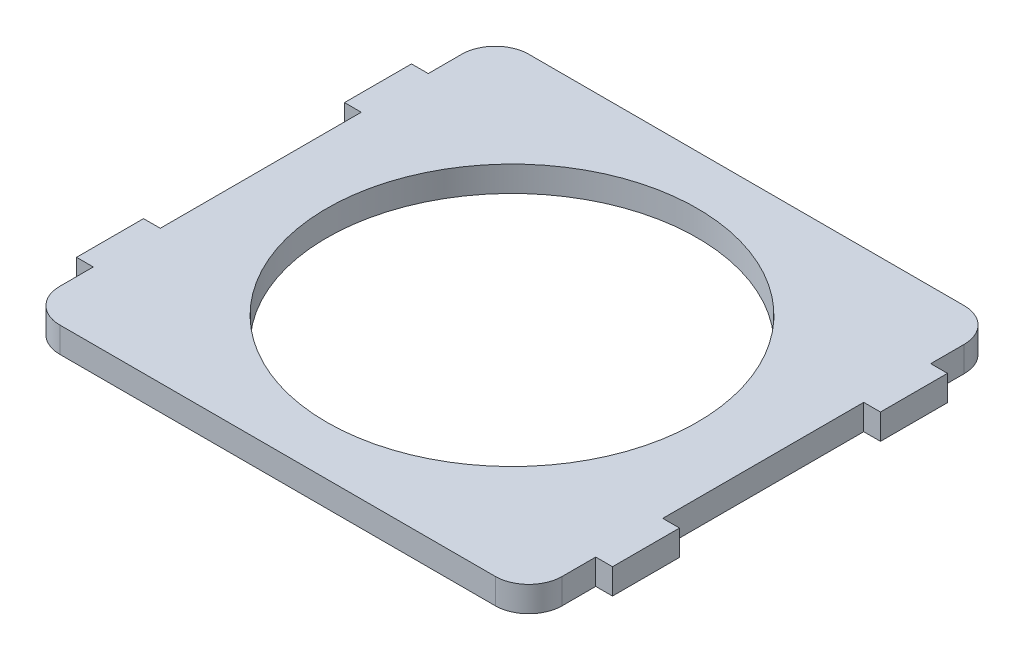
ISO-10303-21;
HEADER;
FILE_DESCRIPTION(('STEP AP214'),'2;1');
FILE_NAME('part.step','',(''),(''),'','','');
FILE_SCHEMA(('AUTOMOTIVE_DESIGN { 1 0 10303 214 1 1 1 1 }'));
ENDSEC;
DATA;
#1=APPLICATION_CONTEXT('core data for automotive mechanical design processes');
#2=APPLICATION_PROTOCOL_DEFINITION('international standard','automotive_design',2000,#1);
#3=PRODUCT_CONTEXT('',#1,'mechanical');
#4=PRODUCT('Part','Part','',(#3));
#5=PRODUCT_RELATED_PRODUCT_CATEGORY('part','',(#4));
#6=PRODUCT_DEFINITION_FORMATION('','',#4);
#7=PRODUCT_DEFINITION_CONTEXT('part definition',#1,'design');
#8=PRODUCT_DEFINITION('design','',#6,#7);
#9=PRODUCT_DEFINITION_SHAPE('','',#8);
#10=(LENGTH_UNIT() NAMED_UNIT(*) SI_UNIT(.MILLI.,.METRE.));
#11=(NAMED_UNIT(*) PLANE_ANGLE_UNIT() SI_UNIT($,.RADIAN.));
#12=(NAMED_UNIT(*) SI_UNIT($,.STERADIAN.) SOLID_ANGLE_UNIT());
#13=UNCERTAINTY_MEASURE_WITH_UNIT(LENGTH_MEASURE(1.E-05),#10,'distance_accuracy_value','');
#14=(GEOMETRIC_REPRESENTATION_CONTEXT(3) GLOBAL_UNCERTAINTY_ASSIGNED_CONTEXT((#13)) GLOBAL_UNIT_ASSIGNED_CONTEXT((#10,
#11,#12)) REPRESENTATION_CONTEXT('',''));
#15=CARTESIAN_POINT('',(0.,0.,0.));
#16=DIRECTION('',(0.,0.,1.));
#17=DIRECTION('',(1.,0.,0.));
#18=AXIS2_PLACEMENT_3D('',#15,#16,#17);
#19=CARTESIAN_POINT('',(0.,9.652,-177.8));
#20=DIRECTION('',(0.,1.,0.));
#21=DIRECTION('',(0.,0.,1.));
#22=AXIS2_PLACEMENT_3D('',#19,#20,#21);
#23=PLANE('',#22);
#24=DIRECTION('',(0.,0.,1.));
#25=VECTOR('',#24,1.);
#26=CARTESIAN_POINT('',(0.,9.652,-25.4));
#27=LINE('',#26,#25);
#28=CARTESIAN_POINT('',(0.,9.652,-25.4));
#29=VERTEX_POINT('',#28);
#30=CARTESIAN_POINT('',(0.,9.652,-12.7));
#31=VERTEX_POINT('',#30);
#32=EDGE_CURVE('E250',#29,#31,#27,.T.);
#33=ORIENTED_EDGE('',*,*,#32,.T.);
#34=CARTESIAN_POINT('',(12.7,9.652,-12.7));
#35=DIRECTION('',(0.,1.,0.));
#36=DIRECTION('',(0.,0.,1.));
#37=AXIS2_PLACEMENT_3D('',#34,#35,#36);
#38=CIRCLE('',#37,12.7);
#39=CARTESIAN_POINT('',(12.7,9.652,0.));
#40=VERTEX_POINT('',#39);
#41=EDGE_CURVE('E354',#31,#40,#38,.T.);
#42=ORIENTED_EDGE('',*,*,#41,.T.);
#43=DIRECTION('',(1.,0.,0.));
#44=VECTOR('',#43,1.);
#45=CARTESIAN_POINT('',(0.,9.652,0.));
#46=LINE('',#45,#44);
#47=CARTESIAN_POINT('',(177.8,9.652,0.));
#48=VERTEX_POINT('',#47);
#49=EDGE_CURVE('E253',#40,#48,#46,.T.);
#50=ORIENTED_EDGE('',*,*,#49,.T.);
#51=CARTESIAN_POINT('',(177.8,9.652,-12.7));
#52=DIRECTION('',(0.,1.,0.));
#53=DIRECTION('',(0.,0.,1.));
#54=AXIS2_PLACEMENT_3D('',#51,#52,#53);
#55=CIRCLE('',#54,12.7);
#56=CARTESIAN_POINT('',(190.5,9.652,-12.7));
#57=VERTEX_POINT('',#56);
#58=EDGE_CURVE('E349',#48,#57,#55,.T.);
#59=ORIENTED_EDGE('',*,*,#58,.T.);
#60=DIRECTION('',(0.,0.,-1.));
#61=VECTOR('',#60,1.);
#62=CARTESIAN_POINT('',(190.5,9.652,-25.4000000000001));
#63=LINE('',#62,#61);
#64=CARTESIAN_POINT('',(190.5,9.652,-25.4000000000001));
#65=VERTEX_POINT('',#64);
#66=EDGE_CURVE('E256',#57,#65,#63,.T.);
#67=ORIENTED_EDGE('',*,*,#66,.T.);
#68=DIRECTION('',(1.,0.,0.));
#69=VECTOR('',#68,1.);
#70=CARTESIAN_POINT('',(196.85,9.652,-25.4));
#71=LINE('',#70,#69);
#72=CARTESIAN_POINT('',(196.85,9.652,-25.4));
#73=VERTEX_POINT('',#72);
#74=EDGE_CURVE('E205',#65,#73,#71,.T.);
#75=ORIENTED_EDGE('',*,*,#74,.T.);
#76=DIRECTION('',(0.,0.,-1.));
#77=VECTOR('',#76,1.);
#78=CARTESIAN_POINT('',(196.85,9.652,-50.8000000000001));
#79=LINE('',#78,#77);
#80=CARTESIAN_POINT('',(196.85,9.652,-50.8000000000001));
#81=VERTEX_POINT('',#80);
#82=EDGE_CURVE('E259',#73,#81,#79,.T.);
#83=ORIENTED_EDGE('',*,*,#82,.T.);
#84=DIRECTION('',(-1.,0.,0.));
#85=VECTOR('',#84,1.);
#86=CARTESIAN_POINT('',(190.5,9.652,-50.8000000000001));
#87=LINE('',#86,#85);
#88=CARTESIAN_POINT('',(190.5,9.652,-50.8000000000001));
#89=VERTEX_POINT('',#88);
#90=EDGE_CURVE('E261',#81,#89,#87,.T.);
#91=ORIENTED_EDGE('',*,*,#90,.T.);
#92=DIRECTION('',(0.,0.,-1.));
#93=VECTOR('',#92,1.);
#94=CARTESIAN_POINT('',(190.5,9.652,-127.));
#95=LINE('',#94,#93);
#96=CARTESIAN_POINT('',(190.5,9.652,-127.));
#97=VERTEX_POINT('',#96);
#98=EDGE_CURVE('E263',#89,#97,#95,.T.);
#99=ORIENTED_EDGE('',*,*,#98,.T.);
#100=DIRECTION('',(1.,0.,0.));
#101=VECTOR('',#100,1.);
#102=CARTESIAN_POINT('',(196.85,9.652,-127.));
#103=LINE('',#102,#101);
#104=CARTESIAN_POINT('',(196.85,9.652,-127.));
#105=VERTEX_POINT('',#104);
#106=EDGE_CURVE('E265',#97,#105,#103,.T.);
#107=ORIENTED_EDGE('',*,*,#106,.T.);
#108=DIRECTION('',(0.,0.,-1.));
#109=VECTOR('',#108,1.);
#110=CARTESIAN_POINT('',(196.85,9.652,-152.4));
#111=LINE('',#110,#109);
#112=CARTESIAN_POINT('',(196.85,9.652,-152.4));
#113=VERTEX_POINT('',#112);
#114=EDGE_CURVE('E267',#105,#113,#111,.T.);
#115=ORIENTED_EDGE('',*,*,#114,.T.);
#116=DIRECTION('',(-1.,0.,0.));
#117=VECTOR('',#116,1.);
#118=CARTESIAN_POINT('',(190.5,9.652,-152.4));
#119=LINE('',#118,#117);
#120=CARTESIAN_POINT('',(190.5,9.652,-152.4));
#121=VERTEX_POINT('',#120);
#122=EDGE_CURVE('E269',#113,#121,#119,.T.);
#123=ORIENTED_EDGE('',*,*,#122,.T.);
#124=DIRECTION('',(0.,0.,-1.));
#125=VECTOR('',#124,1.);
#126=CARTESIAN_POINT('',(190.5,9.652,-177.8));
#127=LINE('',#126,#125);
#128=CARTESIAN_POINT('',(190.5,9.652,-165.1));
#129=VERTEX_POINT('',#128);
#130=EDGE_CURVE('E271',#121,#129,#127,.T.);
#131=ORIENTED_EDGE('',*,*,#130,.T.);
#132=CARTESIAN_POINT('',(177.8,9.652,-165.1));
#133=DIRECTION('',(0.,1.,0.));
#134=DIRECTION('',(0.,0.,1.));
#135=AXIS2_PLACEMENT_3D('',#132,#133,#134);
#136=CIRCLE('',#135,12.7);
#137=CARTESIAN_POINT('',(177.8,9.652,-177.8));
#138=VERTEX_POINT('',#137);
#139=EDGE_CURVE('E351',#129,#138,#136,.T.);
#140=ORIENTED_EDGE('',*,*,#139,.T.);
#141=DIRECTION('',(-1.,0.,0.));
#142=VECTOR('',#141,1.);
#143=CARTESIAN_POINT('',(0.,9.652,-177.8));
#144=LINE('',#143,#142);
#145=CARTESIAN_POINT('',(12.7,9.652,-177.8));
#146=VERTEX_POINT('',#145);
#147=EDGE_CURVE('E274',#138,#146,#144,.T.);
#148=ORIENTED_EDGE('',*,*,#147,.T.);
#149=CARTESIAN_POINT('',(12.7,9.652,-165.1));
#150=DIRECTION('',(0.,1.,0.));
#151=DIRECTION('',(0.,0.,1.));
#152=AXIS2_PLACEMENT_3D('',#149,#150,#151);
#153=CIRCLE('',#152,12.7);
#154=CARTESIAN_POINT('',(0.,9.652,-165.1));
#155=VERTEX_POINT('',#154);
#156=EDGE_CURVE('E41',#146,#155,#153,.T.);
#157=ORIENTED_EDGE('',*,*,#156,.T.);
#158=DIRECTION('',(0.,0.,1.));
#159=VECTOR('',#158,1.);
#160=CARTESIAN_POINT('',(0.,9.652,-177.8));
#161=LINE('',#160,#159);
#162=CARTESIAN_POINT('',(0.,9.652,-152.4));
#163=VERTEX_POINT('',#162);
#164=EDGE_CURVE('E276',#155,#163,#161,.T.);
#165=ORIENTED_EDGE('',*,*,#164,.T.);
#166=DIRECTION('',(-1.,0.,0.));
#167=VECTOR('',#166,1.);
#168=CARTESIAN_POINT('',(0.,9.652,-152.4));
#169=LINE('',#168,#167);
#170=CARTESIAN_POINT('',(-6.34999999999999,9.652,-152.4));
#171=VERTEX_POINT('',#170);
#172=EDGE_CURVE('E278',#163,#171,#169,.T.);
#173=ORIENTED_EDGE('',*,*,#172,.T.);
#174=DIRECTION('',(0.,0.,1.));
#175=VECTOR('',#174,1.);
#176=CARTESIAN_POINT('',(-6.34999999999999,9.652,-152.4));
#177=LINE('',#176,#175);
#178=CARTESIAN_POINT('',(-6.34999999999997,9.652,-127.));
#179=VERTEX_POINT('',#178);
#180=EDGE_CURVE('E280',#171,#179,#177,.T.);
#181=ORIENTED_EDGE('',*,*,#180,.T.);
#182=DIRECTION('',(1.,0.,0.));
#183=VECTOR('',#182,1.);
#184=CARTESIAN_POINT('',(-6.34999999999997,9.652,-127.));
#185=LINE('',#184,#183);
#186=CARTESIAN_POINT('',(0.,9.652,-127.));
#187=VERTEX_POINT('',#186);
#188=EDGE_CURVE('E282',#179,#187,#185,.T.);
#189=ORIENTED_EDGE('',*,*,#188,.T.);
#190=DIRECTION('',(0.,0.,1.));
#191=VECTOR('',#190,1.);
#192=CARTESIAN_POINT('',(0.,9.652,-127.));
#193=LINE('',#192,#191);
#194=CARTESIAN_POINT('',(0.,9.652,-50.8000000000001));
#195=VERTEX_POINT('',#194);
#196=EDGE_CURVE('E284',#187,#195,#193,.T.);
#197=ORIENTED_EDGE('',*,*,#196,.T.);
#198=DIRECTION('',(-1.,0.,0.));
#199=VECTOR('',#198,1.);
#200=CARTESIAN_POINT('',(0.,9.652,-50.8000000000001));
#201=LINE('',#200,#199);
#202=CARTESIAN_POINT('',(-6.34999999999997,9.652,-50.8000000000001));
#203=VERTEX_POINT('',#202);
#204=EDGE_CURVE('E286',#195,#203,#201,.T.);
#205=ORIENTED_EDGE('',*,*,#204,.T.);
#206=DIRECTION('',(0.,0.,1.));
#207=VECTOR('',#206,1.);
#208=CARTESIAN_POINT('',(-6.34999999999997,9.652,-50.8000000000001));
#209=LINE('',#208,#207);
#210=CARTESIAN_POINT('',(-6.34999999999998,9.652,-25.4));
#211=VERTEX_POINT('',#210);
#212=EDGE_CURVE('E288',#203,#211,#209,.T.);
#213=ORIENTED_EDGE('',*,*,#212,.T.);
#214=DIRECTION('',(1.,0.,0.));
#215=VECTOR('',#214,1.);
#216=CARTESIAN_POINT('',(-6.34999999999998,9.652,-25.4));
#217=LINE('',#216,#215);
#218=EDGE_CURVE('E290',#211,#29,#217,.T.);
#219=ORIENTED_EDGE('',*,*,#218,.T.);
#220=EDGE_LOOP('',(#33,#42,#50,#59,#67,#75,#83,#91,#99,#107,#115,#123,#131,#140,#148,#157,#165,
#173,#181,#189,#197,#205,#213,#219));
#221=FACE_BOUND('',#220,.T.);
#222=CARTESIAN_POINT('',(95.25,9.652,-88.9));
#223=DIRECTION('',(0.,1.,0.));
#224=DIRECTION('',(0.,0.,1.));
#225=AXIS2_PLACEMENT_3D('',#222,#223,#224);
#226=CIRCLE('',#225,70.231);
#227=CARTESIAN_POINT('',(95.25,9.652,-18.669));
#228=VERTEX_POINT('',#227);
#229=EDGE_CURVE('E539',#228,#228,#226,.T.);
#230=ORIENTED_EDGE('',*,*,#229,.F.);
#231=EDGE_LOOP('',(#230));
#232=FACE_BOUND('',#231,.T.);
#233=ADVANCED_FACE('F26',(#221,#232),#23,.T.);
#234=CARTESIAN_POINT('',(0.,0.,-177.8));
#235=DIRECTION('',(0.,1.,0.));
#236=DIRECTION('',(0.,0.,1.));
#237=AXIS2_PLACEMENT_3D('',#234,#235,#236);
#238=PLANE('',#237);
#239=DIRECTION('',(1.,0.,0.));
#240=VECTOR('',#239,1.);
#241=CARTESIAN_POINT('',(0.,0.,0.));
#242=LINE('',#241,#240);
#243=CARTESIAN_POINT('',(12.7,0.,0.));
#244=VERTEX_POINT('',#243);
#245=CARTESIAN_POINT('',(177.8,0.,0.));
#246=VERTEX_POINT('',#245);
#247=EDGE_CURVE('E199',#244,#246,#242,.T.);
#248=ORIENTED_EDGE('',*,*,#247,.F.);
#249=CARTESIAN_POINT('',(12.7,0.,-12.7));
#250=DIRECTION('',(0.,1.,0.));
#251=DIRECTION('',(0.,0.,1.));
#252=AXIS2_PLACEMENT_3D('',#249,#250,#251);
#253=CIRCLE('',#252,12.7);
#254=CARTESIAN_POINT('',(0.,0.,-12.7));
#255=VERTEX_POINT('',#254);
#256=EDGE_CURVE('E345',#244,#255,#253,.F.);
#257=ORIENTED_EDGE('',*,*,#256,.T.);
#258=DIRECTION('',(0.,0.,1.));
#259=VECTOR('',#258,1.);
#260=CARTESIAN_POINT('',(0.,0.,-25.4));
#261=LINE('',#260,#259);
#262=CARTESIAN_POINT('',(0.,0.,-25.4));
#263=VERTEX_POINT('',#262);
#264=EDGE_CURVE('E424',#263,#255,#261,.T.);
#265=ORIENTED_EDGE('',*,*,#264,.F.);
#266=DIRECTION('',(1.,0.,0.));
#267=VECTOR('',#266,1.);
#268=CARTESIAN_POINT('',(-6.34999999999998,0.,-25.4));
#269=LINE('',#268,#267);
#270=CARTESIAN_POINT('',(-6.34999999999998,0.,-25.4));
#271=VERTEX_POINT('',#270);
#272=EDGE_CURVE('E248',#271,#263,#269,.T.);
#273=ORIENTED_EDGE('',*,*,#272,.F.);
#274=DIRECTION('',(0.,0.,1.));
#275=VECTOR('',#274,1.);
#276=CARTESIAN_POINT('',(-6.34999999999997,0.,-50.8000000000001));
#277=LINE('',#276,#275);
#278=CARTESIAN_POINT('',(-6.34999999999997,0.,-50.8000000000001));
#279=VERTEX_POINT('',#278);
#280=EDGE_CURVE('E246',#279,#271,#277,.T.);
#281=ORIENTED_EDGE('',*,*,#280,.F.);
#282=DIRECTION('',(-1.,0.,0.));
#283=VECTOR('',#282,1.);
#284=CARTESIAN_POINT('',(0.,0.,-50.8000000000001));
#285=LINE('',#284,#283);
#286=CARTESIAN_POINT('',(0.,0.,-50.8000000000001));
#287=VERTEX_POINT('',#286);
#288=EDGE_CURVE('E244',#287,#279,#285,.T.);
#289=ORIENTED_EDGE('',*,*,#288,.F.);
#290=DIRECTION('',(0.,0.,1.));
#291=VECTOR('',#290,1.);
#292=CARTESIAN_POINT('',(0.,0.,-127.));
#293=LINE('',#292,#291);
#294=CARTESIAN_POINT('',(0.,0.,-127.));
#295=VERTEX_POINT('',#294);
#296=EDGE_CURVE('E242',#295,#287,#293,.T.);
#297=ORIENTED_EDGE('',*,*,#296,.F.);
#298=DIRECTION('',(1.,0.,0.));
#299=VECTOR('',#298,1.);
#300=CARTESIAN_POINT('',(-6.34999999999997,0.,-127.));
#301=LINE('',#300,#299);
#302=CARTESIAN_POINT('',(-6.34999999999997,0.,-127.));
#303=VERTEX_POINT('',#302);
#304=EDGE_CURVE('E240',#303,#295,#301,.T.);
#305=ORIENTED_EDGE('',*,*,#304,.F.);
#306=DIRECTION('',(0.,0.,1.));
#307=VECTOR('',#306,1.);
#308=CARTESIAN_POINT('',(-6.34999999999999,0.,-152.4));
#309=LINE('',#308,#307);
#310=CARTESIAN_POINT('',(-6.34999999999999,0.,-152.4));
#311=VERTEX_POINT('',#310);
#312=EDGE_CURVE('E238',#311,#303,#309,.T.);
#313=ORIENTED_EDGE('',*,*,#312,.F.);
#314=DIRECTION('',(-1.,0.,0.));
#315=VECTOR('',#314,1.);
#316=CARTESIAN_POINT('',(0.,0.,-152.4));
#317=LINE('',#316,#315);
#318=CARTESIAN_POINT('',(0.,0.,-152.4));
#319=VERTEX_POINT('',#318);
#320=EDGE_CURVE('E236',#319,#311,#317,.T.);
#321=ORIENTED_EDGE('',*,*,#320,.F.);
#322=DIRECTION('',(0.,0.,1.));
#323=VECTOR('',#322,1.);
#324=CARTESIAN_POINT('',(0.,0.,-177.8));
#325=LINE('',#324,#323);
#326=CARTESIAN_POINT('',(0.,0.,-165.1));
#327=VERTEX_POINT('',#326);
#328=EDGE_CURVE('E234',#327,#319,#325,.T.);
#329=ORIENTED_EDGE('',*,*,#328,.F.);
#330=CARTESIAN_POINT('',(12.7,0.,-165.1));
#331=DIRECTION('',(0.,1.,0.));
#332=DIRECTION('',(0.,0.,1.));
#333=AXIS2_PLACEMENT_3D('',#330,#331,#332);
#334=CIRCLE('',#333,12.7);
#335=CARTESIAN_POINT('',(12.7,0.,-177.8));
#336=VERTEX_POINT('',#335);
#337=EDGE_CURVE('E343',#327,#336,#334,.F.);
#338=ORIENTED_EDGE('',*,*,#337,.T.);
#339=DIRECTION('',(-1.,0.,0.));
#340=VECTOR('',#339,1.);
#341=CARTESIAN_POINT('',(0.,0.,-177.8));
#342=LINE('',#341,#340);
#343=CARTESIAN_POINT('',(177.8,0.,-177.8));
#344=VERTEX_POINT('',#343);
#345=EDGE_CURVE('E232',#344,#336,#342,.T.);
#346=ORIENTED_EDGE('',*,*,#345,.F.);
#347=CARTESIAN_POINT('',(177.8,0.,-165.1));
#348=DIRECTION('',(0.,1.,0.));
#349=DIRECTION('',(0.,0.,1.));
#350=AXIS2_PLACEMENT_3D('',#347,#348,#349);
#351=CIRCLE('',#350,12.7);
#352=CARTESIAN_POINT('',(190.5,0.,-165.1));
#353=VERTEX_POINT('',#352);
#354=EDGE_CURVE('E341',#344,#353,#351,.F.);
#355=ORIENTED_EDGE('',*,*,#354,.T.);
#356=DIRECTION('',(0.,0.,-1.));
#357=VECTOR('',#356,1.);
#358=CARTESIAN_POINT('',(190.5,0.,-177.8));
#359=LINE('',#358,#357);
#360=CARTESIAN_POINT('',(190.5,0.,-152.4));
#361=VERTEX_POINT('',#360);
#362=EDGE_CURVE('E229',#361,#353,#359,.T.);
#363=ORIENTED_EDGE('',*,*,#362,.F.);
#364=DIRECTION('',(-1.,0.,0.));
#365=VECTOR('',#364,1.);
#366=CARTESIAN_POINT('',(190.5,0.,-152.4));
#367=LINE('',#366,#365);
#368=CARTESIAN_POINT('',(196.85,0.,-152.4));
#369=VERTEX_POINT('',#368);
#370=EDGE_CURVE('E227',#369,#361,#367,.T.);
#371=ORIENTED_EDGE('',*,*,#370,.F.);
#372=DIRECTION('',(0.,0.,-1.));
#373=VECTOR('',#372,1.);
#374=CARTESIAN_POINT('',(196.85,0.,-152.4));
#375=LINE('',#374,#373);
#376=CARTESIAN_POINT('',(196.85,0.,-127.));
#377=VERTEX_POINT('',#376);
#378=EDGE_CURVE('E225',#377,#369,#375,.T.);
#379=ORIENTED_EDGE('',*,*,#378,.F.);
#380=DIRECTION('',(1.,0.,0.));
#381=VECTOR('',#380,1.);
#382=CARTESIAN_POINT('',(196.85,0.,-127.));
#383=LINE('',#382,#381);
#384=CARTESIAN_POINT('',(190.5,0.,-127.));
#385=VERTEX_POINT('',#384);
#386=EDGE_CURVE('E223',#385,#377,#383,.T.);
#387=ORIENTED_EDGE('',*,*,#386,.F.);
#388=DIRECTION('',(0.,0.,-1.));
#389=VECTOR('',#388,1.);
#390=CARTESIAN_POINT('',(190.5,0.,-127.));
#391=LINE('',#390,#389);
#392=CARTESIAN_POINT('',(190.5,0.,-50.8000000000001));
#393=VERTEX_POINT('',#392);
#394=EDGE_CURVE('E221',#393,#385,#391,.T.);
#395=ORIENTED_EDGE('',*,*,#394,.F.);
#396=DIRECTION('',(-1.,0.,0.));
#397=VECTOR('',#396,1.);
#398=CARTESIAN_POINT('',(190.5,0.,-50.8000000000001));
#399=LINE('',#398,#397);
#400=CARTESIAN_POINT('',(196.85,0.,-50.8000000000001));
#401=VERTEX_POINT('',#400);
#402=EDGE_CURVE('E216',#401,#393,#399,.T.);
#403=ORIENTED_EDGE('',*,*,#402,.F.);
#404=DIRECTION('',(0.,0.,-1.));
#405=VECTOR('',#404,1.);
#406=CARTESIAN_POINT('',(196.85,0.,-50.8000000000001));
#407=LINE('',#406,#405);
#408=CARTESIAN_POINT('',(196.85,0.,-25.4));
#409=VERTEX_POINT('',#408);
#410=EDGE_CURVE('E214',#409,#401,#407,.T.);
#411=ORIENTED_EDGE('',*,*,#410,.F.);
#412=DIRECTION('',(1.,0.,0.));
#413=VECTOR('',#412,1.);
#414=CARTESIAN_POINT('',(196.85,0.,-25.4));
#415=LINE('',#414,#413);
#416=CARTESIAN_POINT('',(190.5,0.,-25.4000000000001));
#417=VERTEX_POINT('',#416);
#418=EDGE_CURVE('E198',#417,#409,#415,.T.);
#419=ORIENTED_EDGE('',*,*,#418,.F.);
#420=DIRECTION('',(0.,0.,-1.));
#421=VECTOR('',#420,1.);
#422=CARTESIAN_POINT('',(190.5,0.,-25.4000000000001));
#423=LINE('',#422,#421);
#424=CARTESIAN_POINT('',(190.5,0.,-12.7));
#425=VERTEX_POINT('',#424);
#426=EDGE_CURVE('E189',#425,#417,#423,.T.);
#427=ORIENTED_EDGE('',*,*,#426,.F.);
#428=CARTESIAN_POINT('',(177.8,0.,-12.7));
#429=DIRECTION('',(0.,1.,0.));
#430=DIRECTION('',(0.,0.,1.));
#431=AXIS2_PLACEMENT_3D('',#428,#429,#430);
#432=CIRCLE('',#431,12.7);
#433=EDGE_CURVE('E339',#425,#246,#432,.F.);
#434=ORIENTED_EDGE('',*,*,#433,.T.);
#435=EDGE_LOOP('',(#248,#257,#265,#273,#281,#289,#297,#305,#313,#321,#329,#338,#346,#355,#363,
#371,#379,#387,#395,#403,#411,#419,#427,#434));
#436=FACE_BOUND('',#435,.T.);
#437=CARTESIAN_POINT('',(95.25,0.,-88.9));
#438=DIRECTION('',(0.,1.,0.));
#439=DIRECTION('',(0.,0.,1.));
#440=AXIS2_PLACEMENT_3D('',#437,#438,#439);
#441=CIRCLE('',#440,70.231);
#442=CARTESIAN_POINT('',(95.25,0.,-18.669));
#443=VERTEX_POINT('',#442);
#444=EDGE_CURVE('E542',#443,#443,#441,.T.);
#445=ORIENTED_EDGE('',*,*,#444,.T.);
#446=EDGE_LOOP('',(#445));
#447=FACE_BOUND('',#446,.T.);
#448=ADVANCED_FACE('F211',(#436,#447),#238,.F.);
#449=CARTESIAN_POINT('',(0.,9.652,-25.4));
#450=DIRECTION('',(1.,0.,0.));
#451=DIRECTION('',(0.,0.,-1.));
#452=AXIS2_PLACEMENT_3D('',#449,#450,#451);
#453=PLANE('',#452);
#454=ORIENTED_EDGE('',*,*,#264,.T.);
#455=DIRECTION('',(0.,-1.,0.));
#456=VECTOR('',#455,1.);
#457=CARTESIAN_POINT('',(0.,9.652,-12.7));
#458=LINE('',#457,#456);
#459=EDGE_CURVE('E347',#255,#31,#458,.F.);
#460=ORIENTED_EDGE('',*,*,#459,.T.);
#461=ORIENTED_EDGE('',*,*,#32,.F.);
#462=DIRECTION('',(0.,-1.,0.));
#463=VECTOR('',#462,1.);
#464=CARTESIAN_POINT('',(0.,9.652,-25.4));
#465=LINE('',#464,#463);
#466=EDGE_CURVE('E292',#29,#263,#465,.T.);
#467=ORIENTED_EDGE('',*,*,#466,.T.);
#468=EDGE_LOOP('',(#454,#460,#461,#467));
#469=FACE_BOUND('',#468,.T.);
#470=ADVANCED_FACE('F28',(#469),#453,.F.);
#471=CARTESIAN_POINT('',(0.,9.652,0.));
#472=DIRECTION('',(0.,0.,-1.));
#473=DIRECTION('',(-1.,0.,0.));
#474=AXIS2_PLACEMENT_3D('',#471,#472,#473);
#475=PLANE('',#474);
#476=ORIENTED_EDGE('',*,*,#49,.F.);
#477=DIRECTION('',(0.,-1.,0.));
#478=VECTOR('',#477,1.);
#479=CARTESIAN_POINT('',(12.7,9.652,0.));
#480=LINE('',#479,#478);
#481=EDGE_CURVE('E336',#40,#244,#480,.T.);
#482=ORIENTED_EDGE('',*,*,#481,.T.);
#483=ORIENTED_EDGE('',*,*,#247,.T.);
#484=DIRECTION('',(0.,-1.,0.));
#485=VECTOR('',#484,1.);
#486=CARTESIAN_POINT('',(177.8,9.652,0.));
#487=LINE('',#486,#485);
#488=EDGE_CURVE('E206',#246,#48,#487,.F.);
#489=ORIENTED_EDGE('',*,*,#488,.T.);
#490=EDGE_LOOP('',(#476,#482,#483,#489));
#491=FACE_BOUND('',#490,.T.);
#492=ADVANCED_FACE('F431',(#491),#475,.F.);
#493=CARTESIAN_POINT('',(190.5,9.652,-25.4000000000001));
#494=DIRECTION('',(-1.,0.,0.));
#495=DIRECTION('',(0.,0.,1.));
#496=AXIS2_PLACEMENT_3D('',#493,#494,#495);
#497=PLANE('',#496);
#498=ORIENTED_EDGE('',*,*,#66,.F.);
#499=DIRECTION('',(0.,-1.,0.));
#500=VECTOR('',#499,1.);
#501=CARTESIAN_POINT('',(190.5,9.652,-12.7));
#502=LINE('',#501,#500);
#503=EDGE_CURVE('E11',#57,#425,#502,.T.);
#504=ORIENTED_EDGE('',*,*,#503,.T.);
#505=ORIENTED_EDGE('',*,*,#426,.T.);
#506=DIRECTION('',(0.,-1.,0.));
#507=VECTOR('',#506,1.);
#508=CARTESIAN_POINT('',(190.5,9.652,-25.4000000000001));
#509=LINE('',#508,#507);
#510=EDGE_CURVE('E193',#65,#417,#509,.T.);
#511=ORIENTED_EDGE('',*,*,#510,.F.);
#512=EDGE_LOOP('',(#498,#504,#505,#511));
#513=FACE_BOUND('',#512,.T.);
#514=ADVANCED_FACE('F192',(#513),#497,.F.);
#515=CARTESIAN_POINT('',(196.85,9.652,-25.4));
#516=DIRECTION('',(0.,0.,-1.));
#517=DIRECTION('',(-1.,0.,0.));
#518=AXIS2_PLACEMENT_3D('',#515,#516,#517);
#519=PLANE('',#518);
#520=ORIENTED_EDGE('',*,*,#418,.T.);
#521=DIRECTION('',(0.,-1.,0.));
#522=VECTOR('',#521,1.);
#523=CARTESIAN_POINT('',(196.85,9.652,-25.4));
#524=LINE('',#523,#522);
#525=EDGE_CURVE('E207',#73,#409,#524,.T.);
#526=ORIENTED_EDGE('',*,*,#525,.F.);
#527=ORIENTED_EDGE('',*,*,#74,.F.);
#528=ORIENTED_EDGE('',*,*,#510,.T.);
#529=EDGE_LOOP('',(#520,#526,#527,#528));
#530=FACE_BOUND('',#529,.T.);
#531=ADVANCED_FACE('F202',(#530),#519,.F.);
#532=CARTESIAN_POINT('',(196.85,9.652,-50.8000000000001));
#533=DIRECTION('',(-1.,0.,0.));
#534=DIRECTION('',(0.,0.,1.));
#535=AXIS2_PLACEMENT_3D('',#532,#533,#534);
#536=PLANE('',#535);
#537=ORIENTED_EDGE('',*,*,#410,.T.);
#538=DIRECTION('',(0.,-1.,0.));
#539=VECTOR('',#538,1.);
#540=CARTESIAN_POINT('',(196.85,9.652,-50.8000000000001));
#541=LINE('',#540,#539);
#542=EDGE_CURVE('E331',#81,#401,#541,.T.);
#543=ORIENTED_EDGE('',*,*,#542,.F.);
#544=ORIENTED_EDGE('',*,*,#82,.F.);
#545=ORIENTED_EDGE('',*,*,#525,.T.);
#546=EDGE_LOOP('',(#537,#543,#544,#545));
#547=FACE_BOUND('',#546,.T.);
#548=ADVANCED_FACE('F439',(#547),#536,.F.);
#549=CARTESIAN_POINT('',(190.5,9.652,-50.8000000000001));
#550=DIRECTION('',(0.,0.,1.));
#551=DIRECTION('',(1.,0.,0.));
#552=AXIS2_PLACEMENT_3D('',#549,#550,#551);
#553=PLANE('',#552);
#554=ORIENTED_EDGE('',*,*,#402,.T.);
#555=DIRECTION('',(0.,-1.,0.));
#556=VECTOR('',#555,1.);
#557=CARTESIAN_POINT('',(190.5,9.652,-50.8000000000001));
#558=LINE('',#557,#556);
#559=EDGE_CURVE('E328',#89,#393,#558,.T.);
#560=ORIENTED_EDGE('',*,*,#559,.F.);
#561=ORIENTED_EDGE('',*,*,#90,.F.);
#562=ORIENTED_EDGE('',*,*,#542,.T.);
#563=EDGE_LOOP('',(#554,#560,#561,#562));
#564=FACE_BOUND('',#563,.T.);
#565=ADVANCED_FACE('F443',(#564),#553,.F.);
#566=CARTESIAN_POINT('',(190.5,9.652,-127.));
#567=DIRECTION('',(-1.,0.,0.));
#568=DIRECTION('',(0.,0.,1.));
#569=AXIS2_PLACEMENT_3D('',#566,#567,#568);
#570=PLANE('',#569);
#571=ORIENTED_EDGE('',*,*,#394,.T.);
#572=DIRECTION('',(0.,-1.,0.));
#573=VECTOR('',#572,1.);
#574=CARTESIAN_POINT('',(190.5,9.652,-127.));
#575=LINE('',#574,#573);
#576=EDGE_CURVE('E325',#97,#385,#575,.T.);
#577=ORIENTED_EDGE('',*,*,#576,.F.);
#578=ORIENTED_EDGE('',*,*,#98,.F.);
#579=ORIENTED_EDGE('',*,*,#559,.T.);
#580=EDGE_LOOP('',(#571,#577,#578,#579));
#581=FACE_BOUND('',#580,.T.);
#582=ADVANCED_FACE('F449',(#581),#570,.F.);
#583=CARTESIAN_POINT('',(196.85,9.652,-127.));
#584=DIRECTION('',(0.,0.,-1.));
#585=DIRECTION('',(-1.,0.,0.));
#586=AXIS2_PLACEMENT_3D('',#583,#584,#585);
#587=PLANE('',#586);
#588=ORIENTED_EDGE('',*,*,#386,.T.);
#589=DIRECTION('',(0.,-1.,0.));
#590=VECTOR('',#589,1.);
#591=CARTESIAN_POINT('',(196.85,9.652,-127.));
#592=LINE('',#591,#590);
#593=EDGE_CURVE('E322',#105,#377,#592,.T.);
#594=ORIENTED_EDGE('',*,*,#593,.F.);
#595=ORIENTED_EDGE('',*,*,#106,.F.);
#596=ORIENTED_EDGE('',*,*,#576,.T.);
#597=EDGE_LOOP('',(#588,#594,#595,#596));
#598=FACE_BOUND('',#597,.T.);
#599=ADVANCED_FACE('F453',(#598),#587,.F.);
#600=CARTESIAN_POINT('',(196.85,9.652,-152.4));
#601=DIRECTION('',(-1.,0.,0.));
#602=DIRECTION('',(0.,0.,1.));
#603=AXIS2_PLACEMENT_3D('',#600,#601,#602);
#604=PLANE('',#603);
#605=ORIENTED_EDGE('',*,*,#378,.T.);
#606=DIRECTION('',(0.,-1.,0.));
#607=VECTOR('',#606,1.);
#608=CARTESIAN_POINT('',(196.85,9.652,-152.4));
#609=LINE('',#608,#607);
#610=EDGE_CURVE('E319',#113,#369,#609,.T.);
#611=ORIENTED_EDGE('',*,*,#610,.F.);
#612=ORIENTED_EDGE('',*,*,#114,.F.);
#613=ORIENTED_EDGE('',*,*,#593,.T.);
#614=EDGE_LOOP('',(#605,#611,#612,#613));
#615=FACE_BOUND('',#614,.T.);
#616=ADVANCED_FACE('F458',(#615),#604,.F.);
#617=CARTESIAN_POINT('',(190.5,9.652,-152.4));
#618=DIRECTION('',(0.,0.,1.));
#619=DIRECTION('',(1.,0.,0.));
#620=AXIS2_PLACEMENT_3D('',#617,#618,#619);
#621=PLANE('',#620);
#622=ORIENTED_EDGE('',*,*,#370,.T.);
#623=DIRECTION('',(0.,-1.,0.));
#624=VECTOR('',#623,1.);
#625=CARTESIAN_POINT('',(190.5,9.652,-152.4));
#626=LINE('',#625,#624);
#627=EDGE_CURVE('E316',#121,#361,#626,.T.);
#628=ORIENTED_EDGE('',*,*,#627,.F.);
#629=ORIENTED_EDGE('',*,*,#122,.F.);
#630=ORIENTED_EDGE('',*,*,#610,.T.);
#631=EDGE_LOOP('',(#622,#628,#629,#630));
#632=FACE_BOUND('',#631,.T.);
#633=ADVANCED_FACE('F461',(#632),#621,.F.);
#634=CARTESIAN_POINT('',(190.5,9.652,-177.8));
#635=DIRECTION('',(-1.,0.,0.));
#636=DIRECTION('',(0.,0.,1.));
#637=AXIS2_PLACEMENT_3D('',#634,#635,#636);
#638=PLANE('',#637);
#639=ORIENTED_EDGE('',*,*,#362,.T.);
#640=DIRECTION('',(0.,-1.,0.));
#641=VECTOR('',#640,1.);
#642=CARTESIAN_POINT('',(190.5,9.652,-165.1));
#643=LINE('',#642,#641);
#644=EDGE_CURVE('E34',#353,#129,#643,.F.);
#645=ORIENTED_EDGE('',*,*,#644,.T.);
#646=ORIENTED_EDGE('',*,*,#130,.F.);
#647=ORIENTED_EDGE('',*,*,#627,.T.);
#648=EDGE_LOOP('',(#639,#645,#646,#647));
#649=FACE_BOUND('',#648,.T.);
#650=ADVANCED_FACE('F365',(#649),#638,.F.);
#651=CARTESIAN_POINT('',(0.,9.652,-177.8));
#652=DIRECTION('',(0.,0.,1.));
#653=DIRECTION('',(1.,0.,0.));
#654=AXIS2_PLACEMENT_3D('',#651,#652,#653);
#655=PLANE('',#654);
#656=ORIENTED_EDGE('',*,*,#345,.T.);
#657=DIRECTION('',(0.,-1.,0.));
#658=VECTOR('',#657,1.);
#659=CARTESIAN_POINT('',(12.7,9.652,-177.8));
#660=LINE('',#659,#658);
#661=EDGE_CURVE('E49',#336,#146,#660,.F.);
#662=ORIENTED_EDGE('',*,*,#661,.T.);
#663=ORIENTED_EDGE('',*,*,#147,.F.);
#664=DIRECTION('',(0.,-1.,0.));
#665=VECTOR('',#664,1.);
#666=CARTESIAN_POINT('',(177.8,9.652,-177.8));
#667=LINE('',#666,#665);
#668=EDGE_CURVE('E359',#138,#344,#667,.T.);
#669=ORIENTED_EDGE('',*,*,#668,.T.);
#670=EDGE_LOOP('',(#656,#662,#663,#669));
#671=FACE_BOUND('',#670,.T.);
#672=ADVANCED_FACE('F375',(#671),#655,.F.);
#673=CARTESIAN_POINT('',(0.,9.652,-177.8));
#674=DIRECTION('',(1.,0.,0.));
#675=DIRECTION('',(0.,0.,-1.));
#676=AXIS2_PLACEMENT_3D('',#673,#674,#675);
#677=PLANE('',#676);
#678=ORIENTED_EDGE('',*,*,#164,.F.);
#679=DIRECTION('',(0.,-1.,0.));
#680=VECTOR('',#679,1.);
#681=CARTESIAN_POINT('',(0.,9.652,-165.1));
#682=LINE('',#681,#680);
#683=EDGE_CURVE('E356',#155,#327,#682,.T.);
#684=ORIENTED_EDGE('',*,*,#683,.T.);
#685=ORIENTED_EDGE('',*,*,#328,.T.);
#686=DIRECTION('',(0.,-1.,0.));
#687=VECTOR('',#686,1.);
#688=CARTESIAN_POINT('',(0.,9.652,-152.4));
#689=LINE('',#688,#687);
#690=EDGE_CURVE('E313',#163,#319,#689,.T.);
#691=ORIENTED_EDGE('',*,*,#690,.F.);
#692=EDGE_LOOP('',(#678,#684,#685,#691));
#693=FACE_BOUND('',#692,.T.);
#694=ADVANCED_FACE('F382',(#693),#677,.F.);
#695=CARTESIAN_POINT('',(0.,9.652,-152.4));
#696=DIRECTION('',(0.,0.,1.));
#697=DIRECTION('',(1.,0.,0.));
#698=AXIS2_PLACEMENT_3D('',#695,#696,#697);
#699=PLANE('',#698);
#700=ORIENTED_EDGE('',*,*,#320,.T.);
#701=DIRECTION('',(0.,-1.,0.));
#702=VECTOR('',#701,1.);
#703=CARTESIAN_POINT('',(-6.34999999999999,9.652,-152.4));
#704=LINE('',#703,#702);
#705=EDGE_CURVE('E310',#171,#311,#704,.T.);
#706=ORIENTED_EDGE('',*,*,#705,.F.);
#707=ORIENTED_EDGE('',*,*,#172,.F.);
#708=ORIENTED_EDGE('',*,*,#690,.T.);
#709=EDGE_LOOP('',(#700,#706,#707,#708));
#710=FACE_BOUND('',#709,.T.);
#711=ADVANCED_FACE('F389',(#710),#699,.F.);
#712=CARTESIAN_POINT('',(-6.34999999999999,9.652,-152.4));
#713=DIRECTION('',(1.,0.,0.));
#714=DIRECTION('',(0.,0.,-1.));
#715=AXIS2_PLACEMENT_3D('',#712,#713,#714);
#716=PLANE('',#715);
#717=ORIENTED_EDGE('',*,*,#312,.T.);
#718=DIRECTION('',(0.,-1.,0.));
#719=VECTOR('',#718,1.);
#720=CARTESIAN_POINT('',(-6.34999999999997,9.652,-127.));
#721=LINE('',#720,#719);
#722=EDGE_CURVE('E307',#179,#303,#721,.T.);
#723=ORIENTED_EDGE('',*,*,#722,.F.);
#724=ORIENTED_EDGE('',*,*,#180,.F.);
#725=ORIENTED_EDGE('',*,*,#705,.T.);
#726=EDGE_LOOP('',(#717,#723,#724,#725));
#727=FACE_BOUND('',#726,.T.);
#728=ADVANCED_FACE('F392',(#727),#716,.F.);
#729=CARTESIAN_POINT('',(-6.34999999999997,9.652,-127.));
#730=DIRECTION('',(0.,0.,-1.));
#731=DIRECTION('',(-1.,0.,0.));
#732=AXIS2_PLACEMENT_3D('',#729,#730,#731);
#733=PLANE('',#732);
#734=ORIENTED_EDGE('',*,*,#304,.T.);
#735=DIRECTION('',(0.,-1.,0.));
#736=VECTOR('',#735,1.);
#737=CARTESIAN_POINT('',(0.,9.652,-127.));
#738=LINE('',#737,#736);
#739=EDGE_CURVE('E304',#187,#295,#738,.T.);
#740=ORIENTED_EDGE('',*,*,#739,.F.);
#741=ORIENTED_EDGE('',*,*,#188,.F.);
#742=ORIENTED_EDGE('',*,*,#722,.T.);
#743=EDGE_LOOP('',(#734,#740,#741,#742));
#744=FACE_BOUND('',#743,.T.);
#745=ADVANCED_FACE('F397',(#744),#733,.F.);
#746=CARTESIAN_POINT('',(0.,9.652,-127.));
#747=DIRECTION('',(1.,0.,0.));
#748=DIRECTION('',(0.,0.,-1.));
#749=AXIS2_PLACEMENT_3D('',#746,#747,#748);
#750=PLANE('',#749);
#751=ORIENTED_EDGE('',*,*,#296,.T.);
#752=DIRECTION('',(0.,-1.,0.));
#753=VECTOR('',#752,1.);
#754=CARTESIAN_POINT('',(0.,9.652,-50.8000000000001));
#755=LINE('',#754,#753);
#756=EDGE_CURVE('E301',#195,#287,#755,.T.);
#757=ORIENTED_EDGE('',*,*,#756,.F.);
#758=ORIENTED_EDGE('',*,*,#196,.F.);
#759=ORIENTED_EDGE('',*,*,#739,.T.);
#760=EDGE_LOOP('',(#751,#757,#758,#759));
#761=FACE_BOUND('',#760,.T.);
#762=ADVANCED_FACE('F403',(#761),#750,.F.);
#763=CARTESIAN_POINT('',(0.,9.652,-50.8000000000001));
#764=DIRECTION('',(0.,0.,1.));
#765=DIRECTION('',(1.,0.,0.));
#766=AXIS2_PLACEMENT_3D('',#763,#764,#765);
#767=PLANE('',#766);
#768=ORIENTED_EDGE('',*,*,#288,.T.);
#769=DIRECTION('',(0.,-1.,0.));
#770=VECTOR('',#769,1.);
#771=CARTESIAN_POINT('',(-6.34999999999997,9.652,-50.8000000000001));
#772=LINE('',#771,#770);
#773=EDGE_CURVE('E298',#203,#279,#772,.T.);
#774=ORIENTED_EDGE('',*,*,#773,.F.);
#775=ORIENTED_EDGE('',*,*,#204,.F.);
#776=ORIENTED_EDGE('',*,*,#756,.T.);
#777=EDGE_LOOP('',(#768,#774,#775,#776));
#778=FACE_BOUND('',#777,.T.);
#779=ADVANCED_FACE('F407',(#778),#767,.F.);
#780=CARTESIAN_POINT('',(-6.34999999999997,9.652,-50.8000000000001));
#781=DIRECTION('',(1.,0.,0.));
#782=DIRECTION('',(0.,0.,-1.));
#783=AXIS2_PLACEMENT_3D('',#780,#781,#782);
#784=PLANE('',#783);
#785=ORIENTED_EDGE('',*,*,#280,.T.);
#786=DIRECTION('',(0.,-1.,0.));
#787=VECTOR('',#786,1.);
#788=CARTESIAN_POINT('',(-6.34999999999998,9.652,-25.4));
#789=LINE('',#788,#787);
#790=EDGE_CURVE('E295',#211,#271,#789,.T.);
#791=ORIENTED_EDGE('',*,*,#790,.F.);
#792=ORIENTED_EDGE('',*,*,#212,.F.);
#793=ORIENTED_EDGE('',*,*,#773,.T.);
#794=EDGE_LOOP('',(#785,#791,#792,#793));
#795=FACE_BOUND('',#794,.T.);
#796=ADVANCED_FACE('F412',(#795),#784,.F.);
#797=CARTESIAN_POINT('',(-6.34999999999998,9.652,-25.4));
#798=DIRECTION('',(0.,0.,-1.));
#799=DIRECTION('',(-1.,0.,0.));
#800=AXIS2_PLACEMENT_3D('',#797,#798,#799);
#801=PLANE('',#800);
#802=ORIENTED_EDGE('',*,*,#272,.T.);
#803=ORIENTED_EDGE('',*,*,#466,.F.);
#804=ORIENTED_EDGE('',*,*,#218,.F.);
#805=ORIENTED_EDGE('',*,*,#790,.T.);
#806=EDGE_LOOP('',(#802,#803,#804,#805));
#807=FACE_BOUND('',#806,.T.);
#808=ADVANCED_FACE('F418',(#807),#801,.F.);
#809=CARTESIAN_POINT('',(95.25,9.652,-88.9));
#810=DIRECTION('',(0.,-1.,0.));
#811=DIRECTION('',(0.,0.,-1.));
#812=AXIS2_PLACEMENT_3D('',#809,#810,#811);
#813=CYLINDRICAL_SURFACE('',#812,70.231);
#814=ORIENTED_EDGE('',*,*,#229,.T.);
#815=EDGE_LOOP('',(#814));
#816=FACE_BOUND('',#815,.T.);
#817=ORIENTED_EDGE('',*,*,#444,.F.);
#818=EDGE_LOOP('',(#817));
#819=FACE_BOUND('',#818,.T.);
#820=ADVANCED_FACE('F482',(#816,#819),#813,.F.);
#821=CARTESIAN_POINT('',(12.7,9.652,-12.7));
#822=DIRECTION('',(0.,-1.,0.));
#823=DIRECTION('',(0.,0.,-1.));
#824=AXIS2_PLACEMENT_3D('',#821,#822,#823);
#825=CYLINDRICAL_SURFACE('',#824,12.7);
#826=ORIENTED_EDGE('',*,*,#41,.F.);
#827=ORIENTED_EDGE('',*,*,#459,.F.);
#828=ORIENTED_EDGE('',*,*,#256,.F.);
#829=ORIENTED_EDGE('',*,*,#481,.F.);
#830=EDGE_LOOP('',(#826,#827,#828,#829));
#831=FACE_BOUND('',#830,.T.);
#832=ADVANCED_FACE('F426',(#831),#825,.T.);
#833=CARTESIAN_POINT('',(12.7,9.652,-165.1));
#834=DIRECTION('',(0.,-1.,0.));
#835=DIRECTION('',(0.,0.,-1.));
#836=AXIS2_PLACEMENT_3D('',#833,#834,#835);
#837=CYLINDRICAL_SURFACE('',#836,12.7);
#838=ORIENTED_EDGE('',*,*,#156,.F.);
#839=ORIENTED_EDGE('',*,*,#661,.F.);
#840=ORIENTED_EDGE('',*,*,#337,.F.);
#841=ORIENTED_EDGE('',*,*,#683,.F.);
#842=EDGE_LOOP('',(#838,#839,#840,#841));
#843=FACE_BOUND('',#842,.T.);
#844=ADVANCED_FACE('F380',(#843),#837,.T.);
#845=CARTESIAN_POINT('',(177.8,9.652,-165.1));
#846=DIRECTION('',(0.,-1.,0.));
#847=DIRECTION('',(0.,0.,-1.));
#848=AXIS2_PLACEMENT_3D('',#845,#846,#847);
#849=CYLINDRICAL_SURFACE('',#848,12.7);
#850=ORIENTED_EDGE('',*,*,#139,.F.);
#851=ORIENTED_EDGE('',*,*,#644,.F.);
#852=ORIENTED_EDGE('',*,*,#354,.F.);
#853=ORIENTED_EDGE('',*,*,#668,.F.);
#854=EDGE_LOOP('',(#850,#851,#852,#853));
#855=FACE_BOUND('',#854,.T.);
#856=ADVANCED_FACE('F373',(#855),#849,.T.);
#857=CARTESIAN_POINT('',(177.8,9.652,-12.7));
#858=DIRECTION('',(0.,-1.,0.));
#859=DIRECTION('',(0.,0.,-1.));
#860=AXIS2_PLACEMENT_3D('',#857,#858,#859);
#861=CYLINDRICAL_SURFACE('',#860,12.7);
#862=ORIENTED_EDGE('',*,*,#58,.F.);
#863=ORIENTED_EDGE('',*,*,#488,.F.);
#864=ORIENTED_EDGE('',*,*,#433,.F.);
#865=ORIENTED_EDGE('',*,*,#503,.F.);
#866=EDGE_LOOP('',(#862,#863,#864,#865));
#867=FACE_BOUND('',#866,.T.);
#868=ADVANCED_FACE('F435',(#867),#861,.T.);
#869=CLOSED_SHELL('',(#233,#448,#470,#492,#514,#531,#548,#565,#582,#599,#616,#633,#650,#672,
#694,#711,#728,#745,#762,#779,#796,#808,#820,#832,#844,#856,#868));
#870=MANIFOLD_SOLID_BREP('B2',#869);
#871=ADVANCED_BREP_SHAPE_REPRESENTATION('',(#18,#870),#14);
#872=SHAPE_DEFINITION_REPRESENTATION(#9,#871);
ENDSEC;
END-ISO-10303-21;
